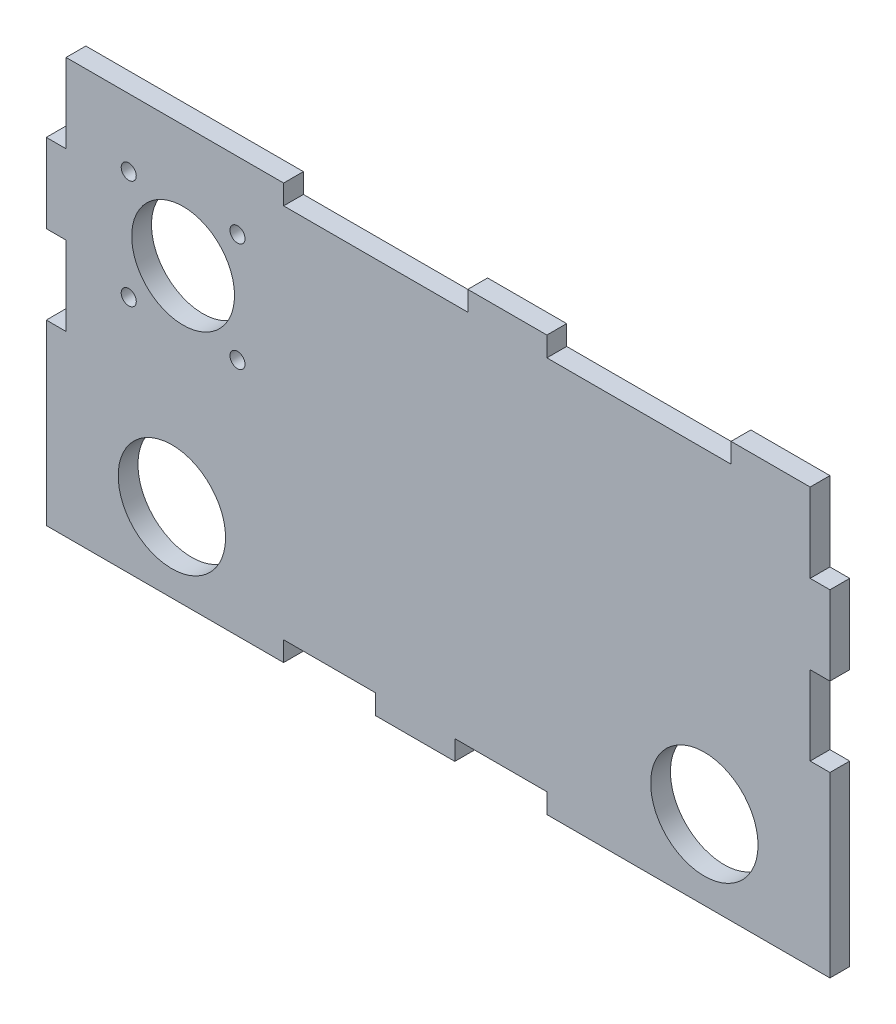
from build123d import *

# Parameters (mm, degrees)
SKETCH1_R           = 13.575
SKETCH1_R_2         = 1.905
SKETCH1_R_3         = 13
BOSS_EXTRUDE1_DEPTH = 5


with BuildPart() as part:
    # Sketch1 → Boss-Extrude1 (new body)
    with BuildSketch(Plane.XY):
        Polygon((0, 0), (0, 45), (5, 45), (5, 65), (0, 65), (0, 85), (5, 85), (5, 105), (60, 105), (60, 100), (106.56, 100), (106.56, 105), (126.56, 105), (126.56, 100), (173.12, 100), (173.12, 105), (193.12, 105), (193.12, 85), (198.12, 85), (198.12, 65), (193.12, 65), (193.12, 45), (198.12, 45), (198.12, 0), (126.56, 0), (126.56, 5), (103.28, 5), (103.28, 0), (83.28, 0), (83.28, 5), (60, 5), (60, 0), align=None)
        with Locations((31.75, 20)):
            Circle(SKETCH1_R, mode=Mode.SUBTRACT)
        with Locations((166.37, 20)):
            Circle(SKETCH1_R, mode=Mode.SUBTRACT)
        with Locations((20.842227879, 87.924331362)):
            Circle(SKETCH1_R_2, mode=Mode.SUBTRACT)
        with Locations((20.842227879, 60.426787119)):
            Circle(SKETCH1_R_2, mode=Mode.SUBTRACT)
        with Locations((48.339772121, 60.426787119)):
            Circle(SKETCH1_R_2, mode=Mode.SUBTRACT)
        with Locations((48.339772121, 87.924331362)):
            Circle(SKETCH1_R_2, mode=Mode.SUBTRACT)
        with Locations((34.591, 74.17555924)):
            Circle(SKETCH1_R_3, mode=Mode.SUBTRACT)
    extrude(amount=BOSS_EXTRUDE1_DEPTH)


solid = part.part
